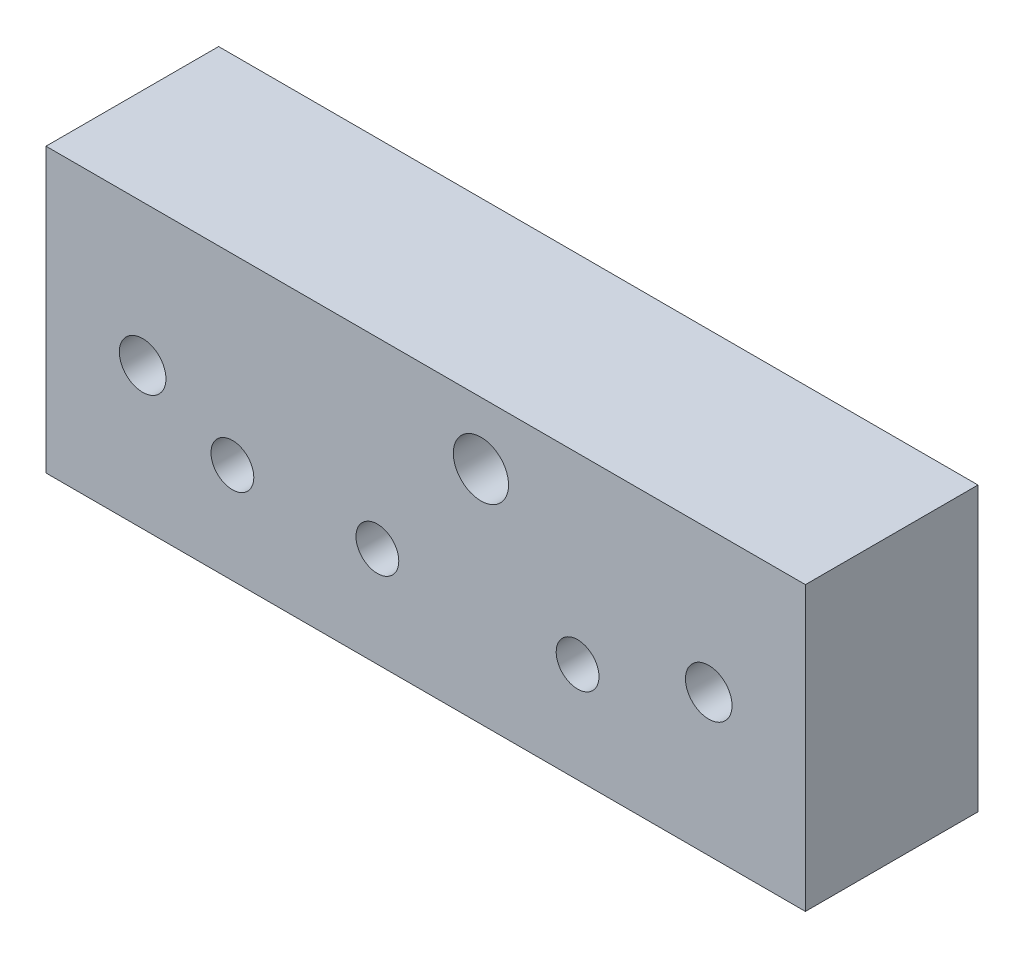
from build123d import *

# Parameters (mm, degrees)
ESQUISSE1_W             = 110
ESQUISSE1_H             = 41
ESQUISSE1_R             = 3.1
BASE_EXTRUSION_DEPTH    = 25
ESQUISSE3_R             = 3.375
ESQUISSE3_R_2           = 4
ENL_V_MAT_EXTRU_2_DEPTH = 349.3948909


with BuildPart() as part:
    # Esquisse1 → Base-Extrusion (new body)
    with BuildSketch(Plane.XY):
        with Locations((270, 102.5)):
            Rectangle(ESQUISSE1_W, ESQUISSE1_H)
        with Locations((292, 96.5)):
            Circle(ESQUISSE1_R, mode=Mode.SUBTRACT)
        with Locations((263, 96.5)):
            Circle(ESQUISSE1_R, mode=Mode.SUBTRACT)
        with Locations((242, 96.5)):
            Circle(ESQUISSE1_R, mode=Mode.SUBTRACT)
    extrude(amount=BASE_EXTRUSION_DEPTH)

    # Enl_v. mat.-Extru.1 cone 1 section (on through the dimple's axis) → Enl_v. mat.-Extru.1 (revolve, cut)
    with BuildSketch(Plane(origin=(242, 96.5, 0), x_dir=(0, 1, 0), z_dir=(1, 0, 0))):
        Polygon((0, 0), (4.1, 0), (0, 78.23266042), align=None)
    revolve(axis=Axis((242, 96.5, 0), (0, 0, 1)), mode=Mode.SUBTRACT)

    # Enl_v. mat.-Extru.1 cone 2 section (on through the dimple's axis) → Enl_v. mat.-Extru.1 cone 2 (revolve, cut)
    with BuildSketch(Plane(origin=(263, 96.5, 0), x_dir=(0, 1, 0), z_dir=(1, 0, 0))):
        Polygon((0, 0), (4.1, 0), (0, 78.23266042), align=None)
    revolve(axis=Axis((263, 96.5, 0), (0, 0, 1)), mode=Mode.SUBTRACT)

    # Enl_v. mat.-Extru.1 cone 3 section (on through the dimple's axis) → Enl_v. mat.-Extru.1 cone 3 (revolve, cut)
    with BuildSketch(Plane(origin=(292, 96.5, 0), x_dir=(0, 1, 0), z_dir=(1, 0, 0))):
        Polygon((0, 0), (4.1, 0), (0, 78.23266042), align=None)
    revolve(axis=Axis((292, 96.5, 0), (0, 0, 1)), mode=Mode.SUBTRACT)

    # Esquisse3 → Enl_v. mat.-Extru.2 (cut, through all)
    with BuildSketch(Plane.XY.offset(25)):
        with Locations((311, 102.5)):
            Circle(ESQUISSE3_R)
        with Locations((229, 102.5)):
            Circle(ESQUISSE3_R)
        with Locations((278, 114)):
            Circle(ESQUISSE3_R_2)
    extrude(amount=-ENL_V_MAT_EXTRU_2_DEPTH, mode=Mode.SUBTRACT)


solid = part.part
